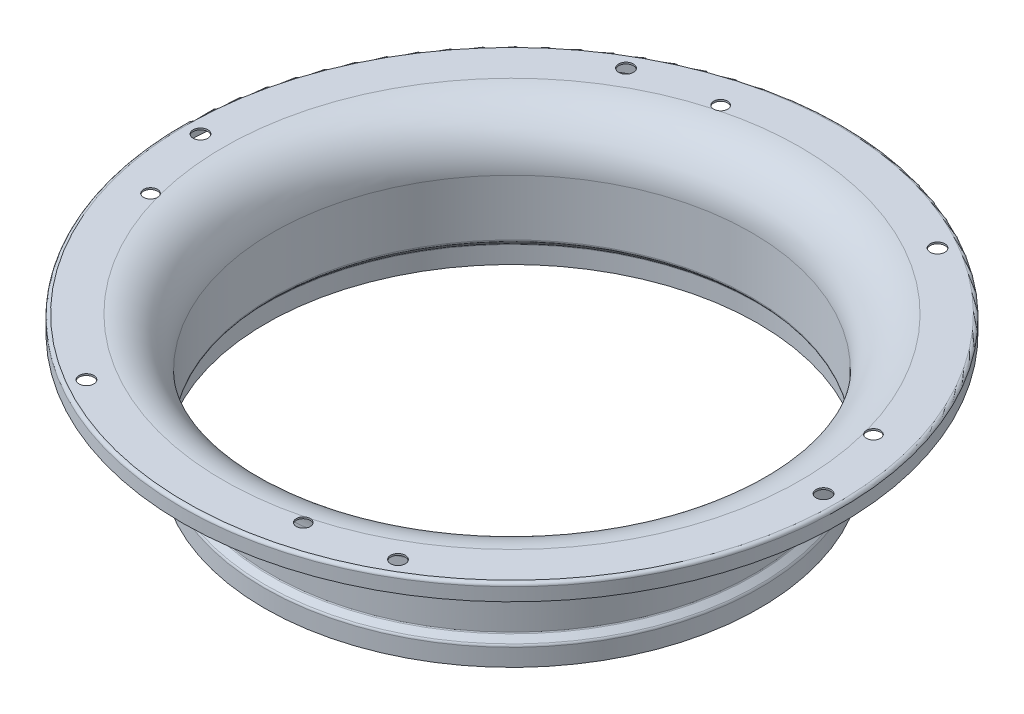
from build123d import *

# Parameters (mm, degrees)
R_P_TITION_CIRCULAIRE1_COUNT = 6
R_P_TITION_CIRCULAIRE2_COUNT = 4


with BuildPart() as part:
    # Esquisse1 → R_volution1 (revolve)
    with BuildSketch(Plane.XY, mode=Mode.PRIVATE) as r_volution1_sk:
        with BuildLine():
            Line((-150, 0), (-150, 10.585786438))
            ThreePointArc((-150, 10.585786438), (-149.923879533, 10.96846987), (-149.707106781, 11.292893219))
            Line((-149.707106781, 11.292893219), (-146.585786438, 14.414213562))
            ThreePointArc((-146.585786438, 14.414213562), (-146.152240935, 15.06306026), (-146, 15.828427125))
            Line((-146, 15.828427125), (-146, 50))
            ThreePointArc((-146, 50), (-154.786796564, 71.213203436), (-176, 80))
            Line((-176, 80), (-199, 80))
            ThreePointArc((-199, 80), (-200.414213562, 79.414213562), (-201, 78))
            Line((-201, 78), (-201, 70))
            Line((-201, 70), (-200, 70))
            Line((-200, 70), (-200, 78))
            ThreePointArc((-200, 78), (-199.707106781, 78.707106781), (-199, 79))
            Line((-199, 79), (-176, 79))
            ThreePointArc((-176, 79), (-155.493903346, 70.506096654), (-147, 50))
            Line((-147, 50), (-147, 15.828427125))
            ThreePointArc((-147, 15.828427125), (-147.076120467, 15.445743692), (-147.292893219, 15.121320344))
            Line((-147.292893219, 15.121320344), (-150.414213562, 12))
            ThreePointArc((-150.414213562, 12), (-150.847759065, 11.351153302), (-151, 10.585786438))
            Line((-151, 10.585786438), (-151, 0))
            Line((-151, 0), (-150, 0))
        make_face()
    revolve(r_volution1_sk.sketch.rotate(Axis((0, 0, 0), (0, 1, 0)), 270), axis=Axis((0, 0, 0), (0, 1, 0)))

    # Esquisse2 → D_gagement M61 (revolve, cut)
    with BuildSketch(Plane(origin=(-190, 80, 0), x_dir=(0, 0, 1), z_dir=(1, 0, 0))):
        Polygon((0, 0), (0, 62.703872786), (4.5, 60), (4.5, 0), align=None)
    d_gagement_m61 = revolve(axis=Axis((-190, 86.35, 0), (0, -1, 0)), mode=Mode.SUBTRACT)

    # R_p_tition circulaire1: D_gagement M61 ×6 about axis
    r_p_tition_circulaire1_axis = Axis((0, 0, 0), (0, 1, 0))
    for i in range(1, R_P_TITION_CIRCULAIRE1_COUNT):
        add(d_gagement_m61.rotate(r_p_tition_circulaire1_axis, i * 360 / R_P_TITION_CIRCULAIRE1_COUNT), mode=Mode.SUBTRACT)

    # Esquisse4 → Diam_tre du per_age M8.5 _8.500000_1 (revolve, cut)
    with BuildSketch(Plane(origin=(46.587428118, 80, 173.866648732), x_dir=(0, 0, 1), z_dir=(1, 0, 0))):
        Polygon((0, 0), (0, 62.553657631), (4.25, 60), (4.25, 0), align=None)
    diam_tre_du_per_age_m8_5_8_500000_1 = revolve(axis=Axis((46.587428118, 86.35, 173.866648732), (0, -1, 0)), mode=Mode.SUBTRACT)

    # R_p_tition circulaire2: Diam_tre du per_age M8.5 _8.500000_1 ×4 about axis
    r_p_tition_circulaire2_axis = Axis((0, 0, 0), (0, 1, 0))
    for i in range(1, R_P_TITION_CIRCULAIRE2_COUNT):
        add(diam_tre_du_per_age_m8_5_8_500000_1.rotate(r_p_tition_circulaire2_axis, i * 360 / R_P_TITION_CIRCULAIRE2_COUNT), mode=Mode.SUBTRACT)


solid = part.part
